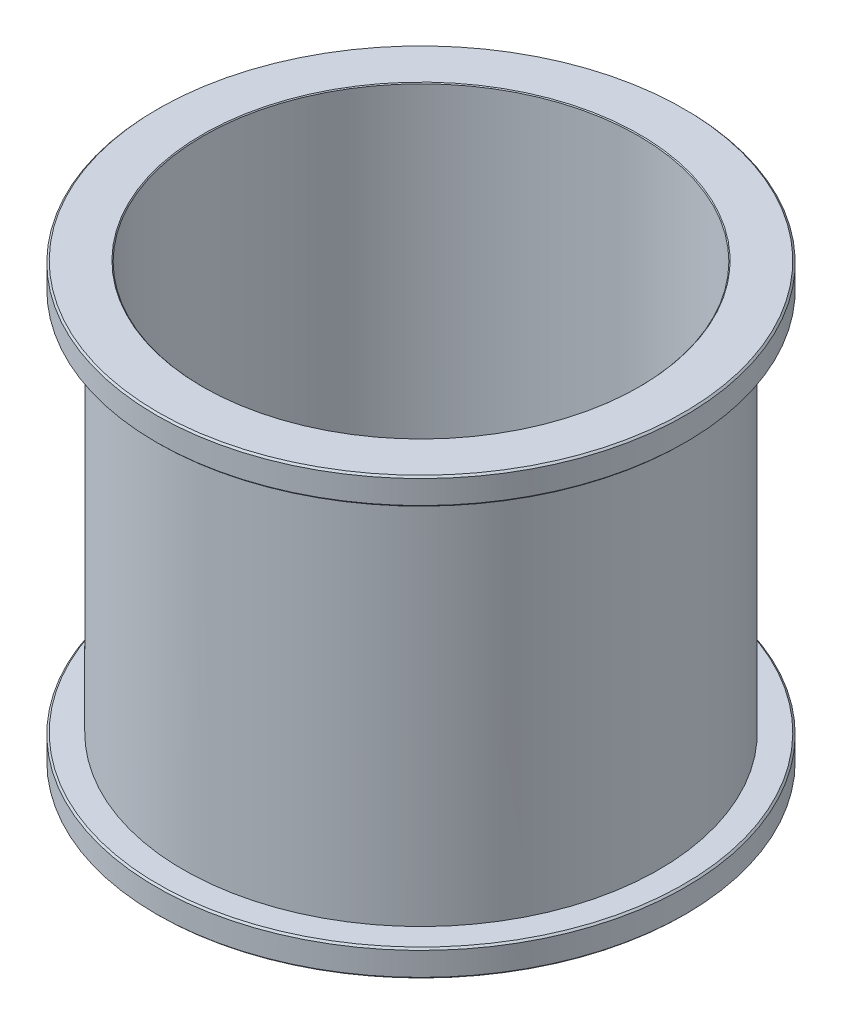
from build123d import *

# Parameters (mm, degrees)
SKETCH1_R           = 71
SKETCH1_R_2         = 65
TUBE_DEPTH          = 130
TOP_START           = -8
SKETCH2_R           = 79
SKETCH2_R_2         = 71
TOP_FLANGE_DEPTH    = 8
SKETCH3_R           = 79
SKETCH3_R_2         = 71
BOTTOM_FLANGE_DEPTH = 8
CHAMFER2_SIZE       = 0.508
CHAMFER3_SIZE       = 0.254


with BuildPart() as part:
    # Sketch1 → tube (new body)
    with BuildSketch(Plane(origin=(0, 0, 0), x_dir=(1, 0, 0), z_dir=(0, 1, 0))):
        with Locations(Location((0, 0, 0), (0, 0, 270))):
            Circle(SKETCH1_R)
        with Locations(Location((0, 0, 0), (0, 0, 270))):
            Circle(SKETCH1_R_2, mode=Mode.SUBTRACT)
    extrude(amount=TUBE_DEPTH)

    # Sketch2 → top flange (add)
    with BuildSketch(Plane(origin=(0, 130, 0), x_dir=(1, 0, 0), z_dir=(0, 1, 0)).offset(TOP_START)):
        with Locations(Location((0, 0, 0), (0, 0, 270))):
            Circle(SKETCH2_R)
        with Locations(Location((0, 0, 0), (0, 0, 270))):
            Circle(SKETCH2_R_2, mode=Mode.SUBTRACT)
    extrude(amount=TOP_FLANGE_DEPTH)

    # Sketch3 → bottom flange (add)
    with BuildSketch(Plane.XZ):
        with Locations(Location((0, 0, 0), (0, 0, 90))):
            Circle(SKETCH3_R)
        with Locations(Location((0, 0, 0), (0, 0, 270))):
            Circle(SKETCH3_R_2, mode=Mode.SUBTRACT)
    extrude(amount=-BOTTOM_FLANGE_DEPTH)

    # Chamfer2
    chamfer2_edges = [part.edges().sort_by_distance(p)[0] for p in [
        (0, 122, -79),
        (0, 130, -79),
        (0, 8, -79),
        (0, 0, -79),
    ]]
    chamfer(chamfer2_edges, length=CHAMFER2_SIZE)

    # Chamfer3
    chamfer3_edges = [part.edges().sort_by_distance(p)[0] for p in [
        (0, 0, -65),
        (0, 130, -65),
    ]]
    chamfer(chamfer3_edges, length=CHAMFER3_SIZE)


solid = part.part
